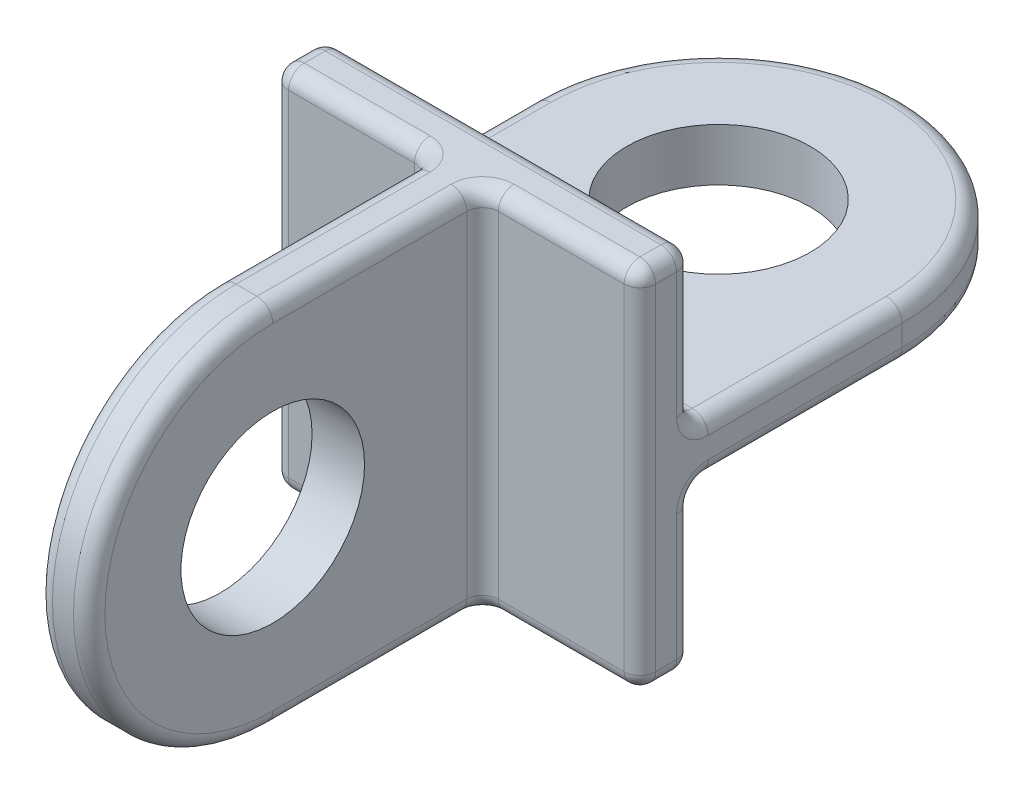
from build123d import *

# Parameters (mm, degrees)
SKETCH1_W           = 70
SKETCH1_H           = 70
BASE_EXTRUDE_DEPTH  = 5
SKETCH2_R           = 17.5
BOSS_EXTRUDE1_DEPTH = 5
SKETCH3_R           = 17.5
BOSS_EXTRUDE2_DEPTH = 5
FILLET1_R           = 3
FILLET2_R           = 3


with BuildPart() as part:
    # Sketch1 → Base-Extrude (new, symmetric)
    with BuildSketch(Plane.XY):
        Rectangle(SKETCH1_W, SKETCH1_H)
    extrude(amount=BASE_EXTRUDE_DEPTH, both=True)

    # Sketch2 → Boss-Extrude1 (add, symmetric)
    with BuildSketch(Plane(origin=(0, 0, 10), x_dir=(1, 0, 0), z_dir=(0, -1, 0))):
        with BuildLine():
            Line((-35, -15), (-35, -55))
            ThreePointArc((-35, -55), (0, -90), (35, -55))
            Line((35, -55), (35, -15))
            Line((35, -15), (-35, -15))
        make_face()
        with Locations(Location((0, -55, 0), (0, 0, 270))):
            Circle(SKETCH2_R, mode=Mode.SUBTRACT)
    extrude(amount=BOSS_EXTRUDE1_DEPTH, both=True)

    # Sketch3 → Boss-Extrude2 (add, symmetric)
    with BuildSketch(Plane(origin=(0, 0, -10), x_dir=(0, -1, 0), z_dir=(1, 0, 0))):
        with BuildLine():
            Line((-35, -15), (-35, -55))
            ThreePointArc((-35, -55), (0, -90), (35, -55))
            Line((35, -55), (35, -15))
            Line((35, -15), (-35, -15))
        make_face()
        with Locations(Location((0, -55, 0), (0, 0, 90))):
            Circle(SKETCH3_R, mode=Mode.SUBTRACT)
    extrude(amount=BOSS_EXTRUDE2_DEPTH, both=True)

    # Fillet1
    fillet1_edges = [part.edges().sort_by_distance(p)[0] for p in [
        (0, -5, -5),
        (0, 5, -5),
        (5, 0, 5),
        (-5, 0, 5),
        (-35, 35, 0),
        (35, 35, 0),
        (35, -35, 0),
        (-35, -35, 0),
    ]]
    fillet(fillet1_edges, radius=FILLET1_R)

    # Fillet2
    fillet2_edges = [part.edges().sort_by_distance(p)[0] for p in [
        (0, -5, -80),
        (35, -5, -26.5),
        (0, 5, -80),
        (35, 5, -26.5),
        (5, 0, 80),
        (5, -35, 26.5),
        (-5, 0, 80),
        (-5, -35, 26.5),
        (-35, 20, -5),
        (-35, 5, -26.5),
        (-35, -5, -26.5),
        (-35, -20, -5),
        (-35, 0, 5),
        (35, 20, -5),
        (0, 35, -5),
        (34.121320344, 34.121320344, -5),
        (-34.121320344, 34.121320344, -5),
        (-20, 35, 5),
        (-5, 35, 26.5),
        (5, 35, 26.5),
        (20, 35, 5),
        (-20, -35, 5),
        (-34.121320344, -34.121320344, 5),
        (-34.121320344, 34.121320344, 5),
        (0, -35, -5),
        (20, -35, 5),
        (35, -20, -5),
        (34.121320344, -34.121320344, -5),
        (-34.121320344, -34.121320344, -5),
        (35, 0, 5),
        (34.121320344, 34.121320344, 5),
        (34.121320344, -34.121320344, 5),
        (5.878679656, 35, 5.878679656),
        (5.878679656, -35, 5.878679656),
        (-5.878679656, 35, 5.878679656),
        (-5.878679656, -35, 5.878679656),
        (-35, 5.878679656, -5.878679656),
        (35, 5.878679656, -5.878679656),
        (-35, -5.878679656, -5.878679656),
        (35, -5.878679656, -5.878679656),
    ]]
    fillet(fillet2_edges, radius=FILLET2_R)


solid = part.part
